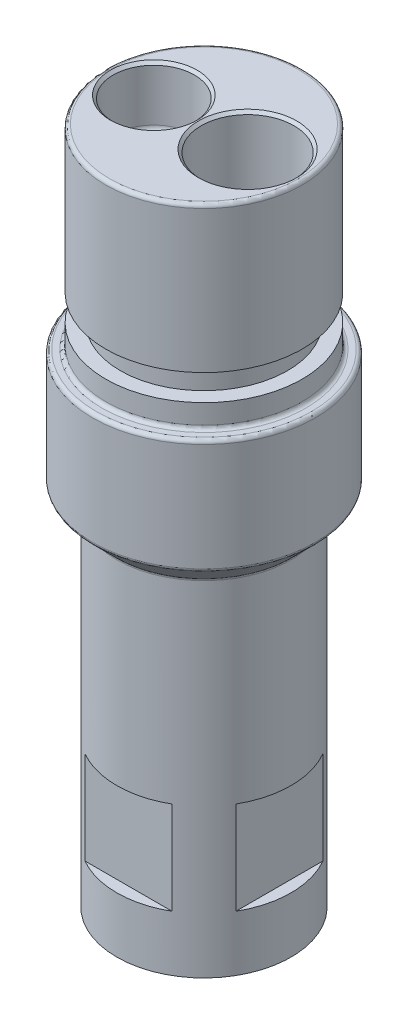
from build123d import *

# Parameters (mm, degrees)
CHAMFER1_SIZE       = 0.381
CUT_EXTRUDE3_START  = -7.62
SKETCH6_OUTSIDE_W   = 52.928
SKETCH6_OUTSIDE_H   = 52.928
SKETCH6_OUTSIDE_W_2 = 20.6375
SKETCH6_OUTSIDE_H_2 = 20.6375
CUT_EXTRUDE3_DEPTH  = 12.7


with BuildPart() as part:
    # Sketch1 → Revolve1 (revolve)
    with BuildSketch(Plane.XY, mode=Mode.PRIVATE) as revolve1_sk:
        with BuildLine():
            Line((-11.9126, 0.508), (-11.9126, 0))
            Line((-11.9126, 0), (-11.1506, 0))
            Line((-11.1506, 0), (-11.1506, 1.27))
            Line((-11.1506, 1.27), (-8.5852, 1.27))
            Line((-8.5852, 1.27), (-8.5852, 0))
            Line((-8.5852, 0), (-6.1341, 0))
            Line((-6.1341, 0), (-6.1341, 3.175))
            Line((-6.1341, 3.175), (-5.7531, 3.403927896))
            Line((-5.7531, 3.403927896), (-5.7531, 66.559453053))
            Line((-5.7531, 66.559453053), (0, 70.01626428))
            Line((0, 70.01626428), (0, 92.71))
            Line((0, 92.71), (-12.92225, 92.71))
            ThreePointArc((-12.92225, 92.71), (-13.281460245, 92.561210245), (-13.43025, 92.202))
            Line((-13.43025, 92.202), (-13.43025, 72.771))
            Line((-13.43025, 72.771), (-11.43, 72.771))
            Line((-11.43, 72.771), (-11.43, 69.215))
            Line((-11.43, 69.215), (-13.43025, 69.215))
            Line((-13.43025, 69.215), (-13.43025, 66.548))
            ThreePointArc((-13.43025, 66.548), (-13.579039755, 66.188789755), (-13.93825, 66.04))
            Line((-13.93825, 66.04), (-14.732, 66.04))
            ThreePointArc((-14.732, 66.04), (-15.091210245, 65.891210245), (-15.24, 65.532))
            Line((-15.24, 65.532), (-15.24, 50.8))
            ThreePointArc((-15.24, 50.8), (-15.201330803, 50.605596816), (-15.091210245, 50.440789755))
            Line((-15.091210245, 50.440789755), (-12.061389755, 47.410969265))
            ThreePointArc((-12.061389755, 47.410969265), (-11.951269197, 47.246162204), (-11.9126, 47.051759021))
            Line((-11.9126, 47.051759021), (-11.9126, 0.508))
        make_face()
    revolve(revolve1_sk.sketch.rotate(Axis((0, 0, 0), (0, -1, 0)), 270), axis=Axis((0, 0, 0), (0, -1, 0)))

    # Sketch2 → Cut-Revolve1 (revolve, cut)
    with BuildSketch(Plane.XY, mode=Mode.PRIVATE) as cut_revolve1_sk:
        with BuildLine():
            Line((-6.858, 92.71), (-6.858, 52.984611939))
            Line((-6.858, 52.984611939), (-4.1529, 54.61))
            Line((-4.1529, 54.61), (-4.1529, 84.455))
            Line((-4.1529, 84.455), (-2.0955, 84.455))
            ThreePointArc((-2.0955, 84.455), (-1.53872412, 84.68562412), (-1.3081, 85.2424))
            Line((-1.3081, 85.2424), (-1.3081, 92.71))
            Line((-1.3081, 92.71), (-6.858, 92.71))
        make_face()
    revolve(cut_revolve1_sk.sketch.rotate(Axis((-6.858, 92.71, 0), (0, -1, 0)), 180), axis=Axis((-6.858, 92.71, 0), (0, -1, 0)), mode=Mode.SUBTRACT)

    # Sketch4 → Cut-Revolve2 (revolve, cut)
    with BuildSketch(Plane.XY, mode=Mode.PRIVATE) as cut_revolve2_sk:
        with BuildLine():
            Line((5.969, 92.71), (12.319, 92.71))
            Line((12.319, 92.71), (12.319, 75.7174))
            ThreePointArc((12.319, 75.7174), (12.08837588, 75.16062412), (11.5316, 74.93))
            Line((11.5316, 74.93), (8.6741, 74.93))
            Line((8.6741, 74.93), (8.6741, 54.61))
            Line((8.6741, 54.61), (5.969, 52.984611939))
            Line((5.969, 52.984611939), (5.969, 92.71))
        make_face()
    revolve(cut_revolve2_sk.sketch.rotate(Axis((5.969, 92.71, 0), (0, -1, 0)), 180), axis=Axis((5.969, 92.71, 0), (0, -1, 0)), mode=Mode.SUBTRACT)

    # Chamfer1
    chamfer1_edges = [part.edges().sort_by_distance(p)[0] for p in [
        (-1.3081, 92.71, 0),
        (12.319, 92.71, 0),
    ]]
    chamfer(chamfer1_edges, length=CHAMFER1_SIZE)

    # Sketch6 outside → Cut-Extrude3 (cut)
    with BuildSketch(Plane.XZ.offset(CUT_EXTRUDE3_START)):
        Rectangle(SKETCH6_OUTSIDE_W, SKETCH6_OUTSIDE_H)
        Rectangle(SKETCH6_OUTSIDE_W_2, SKETCH6_OUTSIDE_H_2, mode=Mode.SUBTRACT)
    extrude(amount=-CUT_EXTRUDE3_DEPTH, mode=Mode.SUBTRACT)


solid = part.part
